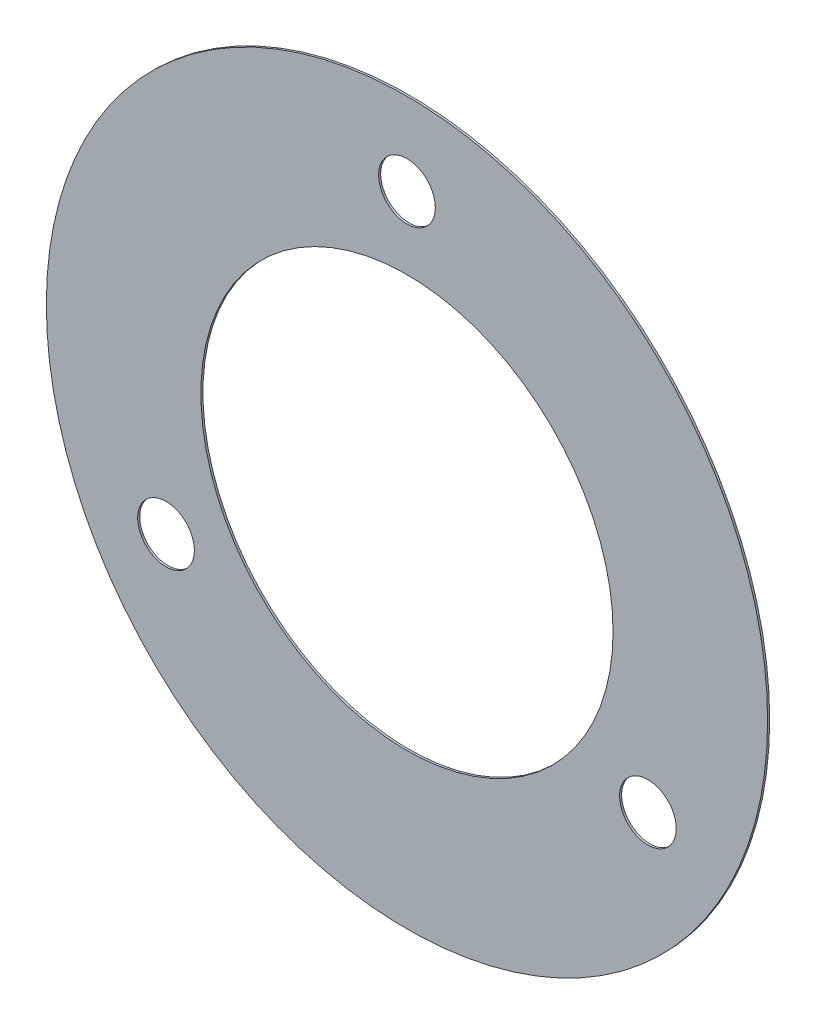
from build123d import *

# Parameters (mm, degrees)
ESQUISSE1_R                  = 70
ESQUISSE1_R_2                = 40
EXTRUSION1_DEPTH             = 0.4
ESQUISSE2_R                  = 5.5
ENL_V_MAT_EXTRU_1_DEPTH      = 99.995757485
R_P_TITION_CIRCULAIRE1_COUNT = 3


with BuildPart() as part:
    # Esquisse1 → Extrusion1 (new body)
    with BuildSketch(Plane.XY):
        Circle(ESQUISSE1_R)
        Circle(ESQUISSE1_R_2, mode=Mode.SUBTRACT)
    extrude(amount=EXTRUSION1_DEPTH)

    # Esquisse2 → Enl_v. mat.-Extru.1 (cut, through all)
    with BuildSketch(Plane.XY.offset(0.4)):
        with Locations((0, 54)):
            Circle(ESQUISSE2_R)
    enl_v_mat_extru_1 = extrude(amount=-ENL_V_MAT_EXTRU_1_DEPTH, mode=Mode.SUBTRACT)

    # R_p_tition circulaire1: Enl_v. mat.-Extru.1 ×3 about axis
    r_p_tition_circulaire1_axis = Axis((0, 0, 0), (0, 0, 1))
    for i in range(1, R_P_TITION_CIRCULAIRE1_COUNT):
        add(enl_v_mat_extru_1.rotate(r_p_tition_circulaire1_axis, i * 360 / R_P_TITION_CIRCULAIRE1_COUNT), mode=Mode.SUBTRACT)


solid = part.part
